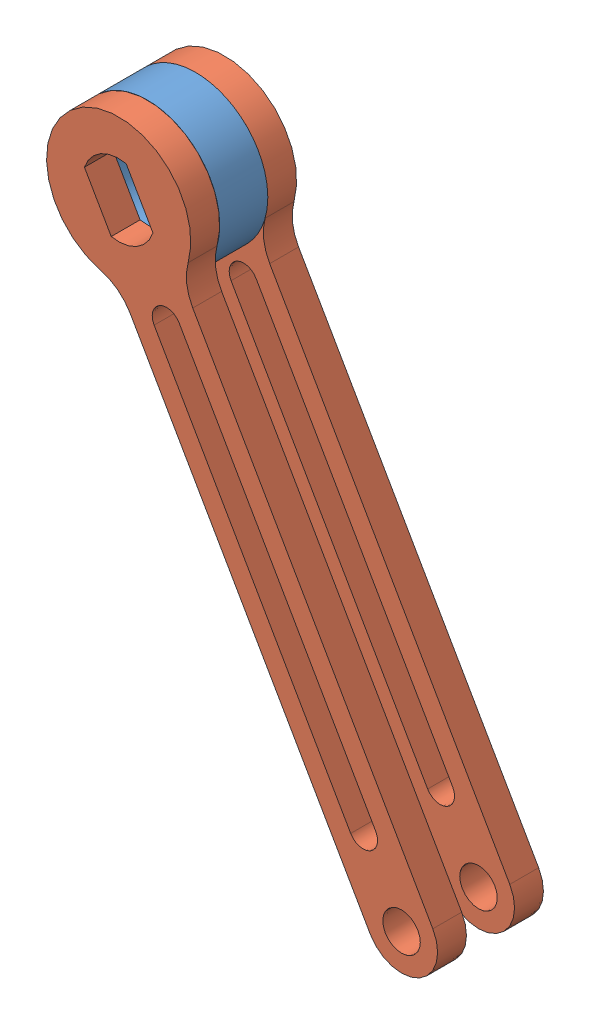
SolidWorks assembly 14G209 - Biellette totale basse.SLDASM, configuration Défaut (file format 10000). Lengths in mm.
3 component instances, 2 part files, 5 mates.
Components (placement in the parent):
- 14G208 - Piece ep10 biellette basse-1: 14G208 - Piece ep10 biellette basse.SLDPRT [Défaut] at (-3.9708 73.5468 0) size (30 30 10)
- 14G204 - Biellette basse-1: 14G204 - Biellette basse.SLDPRT [Défaut] at (-3.9708 73.5468 16) x (0.866948 0.498399 0) z (0.498399 -0.866948 0) size (30 6 140.5)
- 14G204 - Biellette basse-2: 14G204 - Biellette basse.SLDPRT [Défaut] at (-3.9708 73.5468 0) x (0.866948 0.498399 0) z (0.498399 -0.866948 0) size (30 6 140.5)
Mates (geometry in assembly coordinates):
- Coïncidente1: coincident anti-aligned: plane of 14G208 - Piece ep10 biellette basse-1 through (-3.9708 40.4053 10) normal (0 0 1); plane of 14G204 - Biellette basse-1 through (-73.4355 -30.1171 10) normal (0 0 -1)
- Coaxiale1: concentric anti-aligned: cylinder of 14G208 - Piece ep10 biellette basse-1 through (-3.9708 73.5468 10) axis (0 0 -1) radius 7.5; cylinder of 14G204 - Biellette basse-1 through (-3.9708 73.5468 10) axis (0 0 1) radius 7.5
- Coïncidente3: coincident anti-aligned: plane of 14G208 - Piece ep10 biellette basse-1 through (-3.9708 40.4053 0) normal (0 0 -1); plane of 14G204 - Biellette basse-2 through (-73.4355 -30.1171 0) normal (0 0 1)
- Coaxiale2: concentric anti-aligned: cylinder of 14G208 - Piece ep10 biellette basse-1 through (-3.9708 73.5468 10) axis (0 0 -1) radius 7.5; cylinder of 14G204 - Biellette basse-2 through (-3.9708 73.5468 -6) axis (0 0 1) radius 7.5
- Coïncidente4: coincident aligned: plane of 14G204 - Biellette basse-1 through (17.0636 21.9099 10) normal (-0.866948 -0.498399 0); plane of 14G204 - Biellette basse-2 through (17.0636 21.9099 -6) normal (-0.866948 -0.498399 0)
